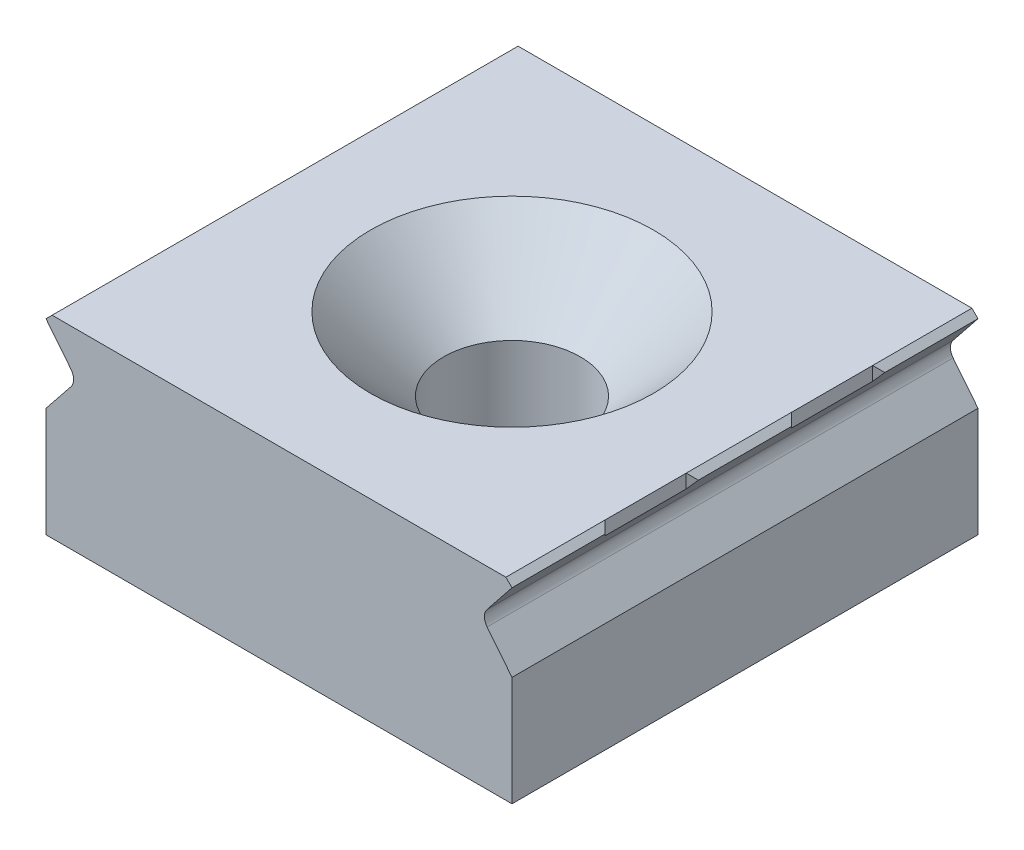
ISO-10303-21;
HEADER;
FILE_DESCRIPTION(('STEP AP214'),'2;1');
FILE_NAME('part.step','',(''),(''),'','','');
FILE_SCHEMA(('AUTOMOTIVE_DESIGN { 1 0 10303 214 1 1 1 1 }'));
ENDSEC;
DATA;
#1=APPLICATION_CONTEXT('core data for automotive mechanical design processes');
#2=APPLICATION_PROTOCOL_DEFINITION('international standard','automotive_design',2000,#1);
#3=PRODUCT_CONTEXT('',#1,'mechanical');
#4=PRODUCT('Part','Part','',(#3));
#5=PRODUCT_RELATED_PRODUCT_CATEGORY('part','',(#4));
#6=PRODUCT_DEFINITION_FORMATION('','',#4);
#7=PRODUCT_DEFINITION_CONTEXT('part definition',#1,'design');
#8=PRODUCT_DEFINITION('design','',#6,#7);
#9=PRODUCT_DEFINITION_SHAPE('','',#8);
#10=(LENGTH_UNIT() NAMED_UNIT(*) SI_UNIT(.MILLI.,.METRE.));
#11=(NAMED_UNIT(*) PLANE_ANGLE_UNIT() SI_UNIT($,.RADIAN.));
#12=(NAMED_UNIT(*) SI_UNIT($,.STERADIAN.) SOLID_ANGLE_UNIT());
#13=UNCERTAINTY_MEASURE_WITH_UNIT(LENGTH_MEASURE(1.E-05),#10,'distance_accuracy_value','');
#14=(GEOMETRIC_REPRESENTATION_CONTEXT(3) GLOBAL_UNCERTAINTY_ASSIGNED_CONTEXT((#13)) GLOBAL_UNIT_ASSIGNED_CONTEXT((#10,
#11,#12)) REPRESENTATION_CONTEXT('',''));
#15=CARTESIAN_POINT('',(0.,0.,0.));
#16=DIRECTION('',(0.,0.,1.));
#17=DIRECTION('',(1.,0.,0.));
#18=AXIS2_PLACEMENT_3D('',#15,#16,#17);
#19=CARTESIAN_POINT('',(9.3,3.96,0.));
#20=DIRECTION('',(0.707106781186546,0.707106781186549,0.));
#21=DIRECTION('',(0.,0.,1.));
#22=AXIS2_PLACEMENT_3D('',#19,#20,#21);
#23=PLANE('',#22);
#24=DIRECTION('',(0.57735018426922,-0.577350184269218,0.577350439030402));
#25=VECTOR('',#24,1.);
#26=CARTESIAN_POINT('',(10.0200001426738,3.23999985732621,-1.43999964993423));
#27=LINE('',#26,#25);
#28=CARTESIAN_POINT('',(9.3,3.96,-2.16000011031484));
#29=VERTEX_POINT('',#28);
#30=CARTESIAN_POINT('',(9.54999999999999,3.70999999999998,-1.91));
#31=VERTEX_POINT('',#30);
#32=EDGE_CURVE('E244',#29,#31,#27,.T.);
#33=ORIENTED_EDGE('',*,*,#32,.F.);
#34=DIRECTION('',(0.,0.,-1.));
#35=VECTOR('',#34,1.);
#36=CARTESIAN_POINT('',(9.3,3.96,-9.55));
#37=LINE('',#36,#35);
#38=CARTESIAN_POINT('',(9.3,3.96,2.15999988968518));
#39=VERTEX_POINT('',#38);
#40=EDGE_CURVE('E343',#39,#29,#37,.T.);
#41=ORIENTED_EDGE('',*,*,#40,.F.);
#42=DIRECTION('',(-0.577350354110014,0.577350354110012,0.577350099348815));
#43=VECTOR('',#42,1.);
#44=CARTESIAN_POINT('',(10.0199998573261,3.2400001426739,1.4400003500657));
#45=LINE('',#44,#43);
#46=CARTESIAN_POINT('',(9.55,3.70999999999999,1.91));
#47=VERTEX_POINT('',#46);
#48=EDGE_CURVE('E254',#47,#39,#45,.T.);
#49=ORIENTED_EDGE('',*,*,#48,.F.);
#50=DIRECTION('',(0.,0.,1.));
#51=VECTOR('',#50,1.);
#52=CARTESIAN_POINT('',(9.55,3.71,9.55));
#53=LINE('',#52,#51);
#54=EDGE_CURVE('E353',#31,#47,#53,.T.);
#55=ORIENTED_EDGE('',*,*,#54,.F.);
#56=EDGE_LOOP('',(#33,#41,#49,#55));
#57=FACE_BOUND('',#56,.T.);
#58=ADVANCED_FACE('F35',(#57),#23,.T.);
#59=CARTESIAN_POINT('',(-9.3,3.96,0.));
#60=DIRECTION('',(-0.707106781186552,0.707106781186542,0.));
#61=DIRECTION('',(0.,0.,-1.));
#62=AXIS2_PLACEMENT_3D('',#59,#60,#61);
#63=PLANE('',#62);
#64=DIRECTION('',(0.577350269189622,0.577350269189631,-0.577350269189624));
#65=VECTOR('',#64,1.);
#66=CARTESIAN_POINT('',(-10.02,3.23999999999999,-1.44000000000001));
#67=LINE('',#66,#65);
#68=CARTESIAN_POINT('',(-9.55000000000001,3.71,-1.91));
#69=VERTEX_POINT('',#68);
#70=CARTESIAN_POINT('',(-9.3,3.96,-2.16000000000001));
#71=VERTEX_POINT('',#70);
#72=EDGE_CURVE('E196',#69,#71,#67,.T.);
#73=ORIENTED_EDGE('',*,*,#72,.F.);
#74=DIRECTION('',(0.,0.,-1.));
#75=VECTOR('',#74,1.);
#76=CARTESIAN_POINT('',(-9.55,3.71,-9.55));
#77=LINE('',#76,#75);
#78=CARTESIAN_POINT('',(-9.55,3.70999999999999,1.91000000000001));
#79=VERTEX_POINT('',#78);
#80=EDGE_CURVE('E363',#79,#69,#77,.T.);
#81=ORIENTED_EDGE('',*,*,#80,.F.);
#82=DIRECTION('',(-0.577350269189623,-0.577350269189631,-0.577350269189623));
#83=VECTOR('',#82,1.);
#84=CARTESIAN_POINT('',(-10.02,3.24,1.44000000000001));
#85=LINE('',#84,#83);
#86=CARTESIAN_POINT('',(-9.29999999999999,3.96,2.16000000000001));
#87=VERTEX_POINT('',#86);
#88=EDGE_CURVE('E219',#87,#79,#85,.T.);
#89=ORIENTED_EDGE('',*,*,#88,.F.);
#90=DIRECTION('',(0.,0.,1.));
#91=VECTOR('',#90,1.);
#92=CARTESIAN_POINT('',(-9.3,3.96,9.55));
#93=LINE('',#92,#91);
#94=EDGE_CURVE('E217',#71,#87,#93,.T.);
#95=ORIENTED_EDGE('',*,*,#94,.F.);
#96=EDGE_LOOP('',(#73,#81,#89,#95));
#97=FACE_BOUND('',#96,.T.);
#98=ADVANCED_FACE('F218',(#97),#63,.T.);
#99=DIRECTION('',(0.57735018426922,-0.577350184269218,0.577350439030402));
#100=VECTOR('',#99,1.);
#101=CARTESIAN_POINT('',(7.47333310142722,5.78666689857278,3.65333218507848));
#102=LINE('',#101,#100);
#103=CARTESIAN_POINT('',(9.3,3.96,5.47999988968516));
#104=VERTEX_POINT('',#103);
#105=CARTESIAN_POINT('',(9.55,3.70999999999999,5.73));
#106=VERTEX_POINT('',#105);
#107=EDGE_CURVE('E264',#104,#106,#102,.T.);
#108=ORIENTED_EDGE('',*,*,#107,.F.);
#109=CARTESIAN_POINT('',(9.3,3.96,9.55));
#110=VERTEX_POINT('',#109);
#111=EDGE_CURVE('E339',#110,#104,#37,.T.);
#112=ORIENTED_EDGE('',*,*,#111,.F.);
#113=DIRECTION('',(-0.707106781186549,0.707106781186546,0.));
#114=VECTOR('',#113,1.);
#115=CARTESIAN_POINT('',(9.3,3.96,9.55));
#116=LINE('',#115,#114);
#117=CARTESIAN_POINT('',(9.55,3.71,9.55));
#118=VERTEX_POINT('',#117);
#119=EDGE_CURVE('E356',#118,#110,#116,.T.);
#120=ORIENTED_EDGE('',*,*,#119,.F.);
#121=EDGE_CURVE('E348',#106,#118,#53,.T.);
#122=ORIENTED_EDGE('',*,*,#121,.F.);
#123=EDGE_LOOP('',(#108,#112,#120,#122));
#124=FACE_BOUND('',#123,.T.);
#125=ADVANCED_FACE('F406',(#124),#23,.T.);
#126=DIRECTION('',(0.577350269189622,0.577350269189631,-0.577350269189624));
#127=VECTOR('',#126,1.);
#128=CARTESIAN_POINT('',(-7.47333333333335,5.78666666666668,3.65333333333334));
#129=LINE('',#128,#127);
#130=CARTESIAN_POINT('',(-9.55,3.70999999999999,5.73));
#131=VERTEX_POINT('',#130);
#132=CARTESIAN_POINT('',(-9.29999999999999,3.96,5.47999999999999));
#133=VERTEX_POINT('',#132);
#134=EDGE_CURVE('E267',#131,#133,#129,.T.);
#135=ORIENTED_EDGE('',*,*,#134,.F.);
#136=CARTESIAN_POINT('',(-9.55,3.71,9.55));
#137=VERTEX_POINT('',#136);
#138=EDGE_CURVE('E359',#137,#131,#77,.T.);
#139=ORIENTED_EDGE('',*,*,#138,.F.);
#140=DIRECTION('',(-0.707106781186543,-0.707106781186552,0.));
#141=VECTOR('',#140,1.);
#142=CARTESIAN_POINT('',(-9.3,3.96,9.55));
#143=LINE('',#142,#141);
#144=CARTESIAN_POINT('',(-9.3,3.96,9.55));
#145=VERTEX_POINT('',#144);
#146=EDGE_CURVE('E352',#145,#137,#143,.T.);
#147=ORIENTED_EDGE('',*,*,#146,.F.);
#148=EDGE_CURVE('E224',#133,#145,#93,.T.);
#149=ORIENTED_EDGE('',*,*,#148,.F.);
#150=EDGE_LOOP('',(#135,#139,#147,#149));
#151=FACE_BOUND('',#150,.T.);
#152=ADVANCED_FACE('F411',(#151),#63,.T.);
#153=CARTESIAN_POINT('',(9.55,3.96,9.55));
#154=DIRECTION('',(0.,0.,-1.));
#155=DIRECTION('',(-1.,0.,0.));
#156=AXIS2_PLACEMENT_3D('',#153,#154,#155);
#157=PLANE('',#156);
#158=DIRECTION('',(-0.624095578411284,0.781348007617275,0.));
#159=VECTOR('',#158,1.);
#160=CARTESIAN_POINT('',(8.52924571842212,1.80795221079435,9.55));
#161=LINE('',#160,#159);
#162=CARTESIAN_POINT('',(9.55,0.529999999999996,9.55));
#163=VERTEX_POINT('',#162);
#164=CARTESIAN_POINT('',(8.52924571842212,1.80795221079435,9.55));
#165=VERTEX_POINT('',#164);
#166=EDGE_CURVE('E283',#163,#165,#161,.T.);
#167=ORIENTED_EDGE('',*,*,#166,.T.);
#168=CARTESIAN_POINT('',(8.91991972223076,2.12,9.55));
#169=DIRECTION('',(0.,0.,-1.));
#170=DIRECTION('',(1.,0.,0.));
#171=AXIS2_PLACEMENT_3D('',#168,#169,#170);
#172=CIRCLE('',#171,0.5);
#173=CARTESIAN_POINT('',(8.52924571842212,2.43204778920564,9.55));
#174=VERTEX_POINT('',#173);
#175=EDGE_CURVE('E280',#165,#174,#172,.T.);
#176=ORIENTED_EDGE('',*,*,#175,.T.);
#177=DIRECTION('',(0.624095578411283,0.781348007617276,0.));
#178=VECTOR('',#177,1.);
#179=CARTESIAN_POINT('',(9.55,3.71,9.55));
#180=LINE('',#179,#178);
#181=EDGE_CURVE('E269',#174,#118,#180,.T.);
#182=ORIENTED_EDGE('',*,*,#181,.T.);
#183=ORIENTED_EDGE('',*,*,#119,.T.);
#184=DIRECTION('',(1.,0.,0.));
#185=VECTOR('',#184,1.);
#186=CARTESIAN_POINT('',(9.55,3.96,9.55));
#187=LINE('',#186,#185);
#188=EDGE_CURVE('E315',#145,#110,#187,.T.);
#189=ORIENTED_EDGE('',*,*,#188,.F.);
#190=ORIENTED_EDGE('',*,*,#146,.T.);
#191=DIRECTION('',(-0.624095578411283,0.781348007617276,0.));
#192=VECTOR('',#191,1.);
#193=CARTESIAN_POINT('',(-9.55,3.71,9.55));
#194=LINE('',#193,#192);
#195=CARTESIAN_POINT('',(-8.52924571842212,2.43204778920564,9.55));
#196=VERTEX_POINT('',#195);
#197=EDGE_CURVE('E277',#196,#137,#194,.T.);
#198=ORIENTED_EDGE('',*,*,#197,.F.);
#199=CARTESIAN_POINT('',(-8.91991972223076,2.12,9.55));
#200=DIRECTION('',(0.,0.,1.));
#201=DIRECTION('',(-1.,0.,0.));
#202=AXIS2_PLACEMENT_3D('',#199,#200,#201);
#203=CIRCLE('',#202,0.5);
#204=CARTESIAN_POINT('',(-8.52924571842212,1.80795221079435,9.55));
#205=VERTEX_POINT('',#204);
#206=EDGE_CURVE('E307',#205,#196,#203,.T.);
#207=ORIENTED_EDGE('',*,*,#206,.F.);
#208=DIRECTION('',(0.624095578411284,0.781348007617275,0.));
#209=VECTOR('',#208,1.);
#210=CARTESIAN_POINT('',(-8.52924571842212,1.80795221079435,9.55));
#211=LINE('',#210,#209);
#212=CARTESIAN_POINT('',(-9.55,0.529999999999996,9.55));
#213=VERTEX_POINT('',#212);
#214=EDGE_CURVE('E304',#213,#205,#211,.T.);
#215=ORIENTED_EDGE('',*,*,#214,.F.);
#216=DIRECTION('',(0.,-1.,0.));
#217=VECTOR('',#216,1.);
#218=CARTESIAN_POINT('',(-9.55,3.96,9.55));
#219=LINE('',#218,#217);
#220=CARTESIAN_POINT('',(-9.55,-3.96,9.55));
#221=VERTEX_POINT('',#220);
#222=EDGE_CURVE('E336',#213,#221,#219,.T.);
#223=ORIENTED_EDGE('',*,*,#222,.T.);
#224=DIRECTION('',(1.,0.,0.));
#225=VECTOR('',#224,1.);
#226=CARTESIAN_POINT('',(9.55,-3.96,9.55));
#227=LINE('',#226,#225);
#228=CARTESIAN_POINT('',(9.55,-3.96,9.55));
#229=VERTEX_POINT('',#228);
#230=EDGE_CURVE('E323',#221,#229,#227,.T.);
#231=ORIENTED_EDGE('',*,*,#230,.T.);
#232=DIRECTION('',(0.,-1.,0.));
#233=VECTOR('',#232,1.);
#234=CARTESIAN_POINT('',(9.55,3.96,9.55));
#235=LINE('',#234,#233);
#236=EDGE_CURVE('E334',#163,#229,#235,.T.);
#237=ORIENTED_EDGE('',*,*,#236,.F.);
#238=EDGE_LOOP('',(#167,#176,#182,#183,#189,#190,#198,#207,#215,#223,#231,#237));
#239=FACE_BOUND('',#238,.T.);
#240=ADVANCED_FACE('F464',(#239),#157,.F.);
#241=CARTESIAN_POINT('',(9.55,3.96,9.55));
#242=DIRECTION('',(-1.,0.,0.));
#243=DIRECTION('',(0.,0.,1.));
#244=AXIS2_PLACEMENT_3D('',#241,#242,#243);
#245=PLANE('',#244);
#246=DIRECTION('',(0.,0.,1.));
#247=VECTOR('',#246,1.);
#248=CARTESIAN_POINT('',(9.55,0.529999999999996,-12.9248305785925));
#249=LINE('',#248,#247);
#250=CARTESIAN_POINT('',(9.55,0.529999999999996,-9.55));
#251=VERTEX_POINT('',#250);
#252=EDGE_CURVE('E287',#251,#163,#249,.T.);
#253=ORIENTED_EDGE('',*,*,#252,.T.);
#254=ORIENTED_EDGE('',*,*,#236,.T.);
#255=DIRECTION('',(0.,0.,-1.));
#256=VECTOR('',#255,1.);
#257=CARTESIAN_POINT('',(9.55,-3.96,9.55));
#258=LINE('',#257,#256);
#259=CARTESIAN_POINT('',(9.55,-3.96,-9.55));
#260=VERTEX_POINT('',#259);
#261=EDGE_CURVE('E326',#229,#260,#258,.T.);
#262=ORIENTED_EDGE('',*,*,#261,.T.);
#263=DIRECTION('',(0.,-1.,0.));
#264=VECTOR('',#263,1.);
#265=CARTESIAN_POINT('',(9.55,3.96,-9.55));
#266=LINE('',#265,#264);
#267=EDGE_CURVE('E332',#251,#260,#266,.T.);
#268=ORIENTED_EDGE('',*,*,#267,.F.);
#269=EDGE_LOOP('',(#253,#254,#262,#268));
#270=FACE_BOUND('',#269,.T.);
#271=ADVANCED_FACE('F538',(#270),#245,.F.);
#272=CARTESIAN_POINT('',(9.55,3.96,-9.55));
#273=DIRECTION('',(0.,0.,1.));
#274=DIRECTION('',(1.,0.,0.));
#275=AXIS2_PLACEMENT_3D('',#272,#273,#274);
#276=PLANE('',#275);
#277=DIRECTION('',(0.624095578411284,-0.781348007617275,0.));
#278=VECTOR('',#277,1.);
#279=CARTESIAN_POINT('',(8.52924571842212,1.80795221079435,-9.55));
#280=LINE('',#279,#278);
#281=CARTESIAN_POINT('',(8.52924571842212,1.80795221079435,-9.55));
#282=VERTEX_POINT('',#281);
#283=EDGE_CURVE('E270',#282,#251,#280,.T.);
#284=ORIENTED_EDGE('',*,*,#283,.T.);
#285=ORIENTED_EDGE('',*,*,#267,.T.);
#286=DIRECTION('',(-1.,0.,0.));
#287=VECTOR('',#286,1.);
#288=CARTESIAN_POINT('',(9.55,-3.96,-9.55));
#289=LINE('',#288,#287);
#290=CARTESIAN_POINT('',(-9.55,-3.96,-9.55));
#291=VERTEX_POINT('',#290);
#292=EDGE_CURVE('E318',#260,#291,#289,.T.);
#293=ORIENTED_EDGE('',*,*,#292,.T.);
#294=DIRECTION('',(0.,-1.,0.));
#295=VECTOR('',#294,1.);
#296=CARTESIAN_POINT('',(-9.55,3.96,-9.55));
#297=LINE('',#296,#295);
#298=CARTESIAN_POINT('',(-9.55,0.529999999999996,-9.55));
#299=VERTEX_POINT('',#298);
#300=EDGE_CURVE('E320',#299,#291,#297,.T.);
#301=ORIENTED_EDGE('',*,*,#300,.F.);
#302=DIRECTION('',(-0.624095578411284,-0.781348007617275,0.));
#303=VECTOR('',#302,1.);
#304=CARTESIAN_POINT('',(-8.52924571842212,1.80795221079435,-9.55));
#305=LINE('',#304,#303);
#306=CARTESIAN_POINT('',(-8.52924571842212,1.80795221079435,-9.55));
#307=VERTEX_POINT('',#306);
#308=EDGE_CURVE('E295',#307,#299,#305,.T.);
#309=ORIENTED_EDGE('',*,*,#308,.F.);
#310=CARTESIAN_POINT('',(-8.91991972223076,2.12,-9.55));
#311=DIRECTION('',(0.,0.,1.));
#312=DIRECTION('',(1.,0.,0.));
#313=AXIS2_PLACEMENT_3D('',#310,#311,#312);
#314=CIRCLE('',#313,0.5);
#315=CARTESIAN_POINT('',(-8.52924571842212,2.43204778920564,-9.55));
#316=VERTEX_POINT('',#315);
#317=EDGE_CURVE('E297',#316,#307,#314,.F.);
#318=ORIENTED_EDGE('',*,*,#317,.F.);
#319=DIRECTION('',(0.624095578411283,-0.781348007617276,0.));
#320=VECTOR('',#319,1.);
#321=CARTESIAN_POINT('',(-9.55,3.71,-9.55));
#322=LINE('',#321,#320);
#323=CARTESIAN_POINT('',(-9.55,3.71,-9.55));
#324=VERTEX_POINT('',#323);
#325=EDGE_CURVE('E300',#324,#316,#322,.T.);
#326=ORIENTED_EDGE('',*,*,#325,.F.);
#327=DIRECTION('',(0.707106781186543,0.707106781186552,0.));
#328=VECTOR('',#327,1.);
#329=CARTESIAN_POINT('',(-9.3,3.96,-9.55));
#330=LINE('',#329,#328);
#331=CARTESIAN_POINT('',(-9.3,3.96,-9.55));
#332=VERTEX_POINT('',#331);
#333=EDGE_CURVE('E342',#324,#332,#330,.T.);
#334=ORIENTED_EDGE('',*,*,#333,.T.);
#335=DIRECTION('',(-1.,0.,0.));
#336=VECTOR('',#335,1.);
#337=CARTESIAN_POINT('',(9.55,3.96,-9.55));
#338=LINE('',#337,#336);
#339=CARTESIAN_POINT('',(9.3,3.96,-9.55));
#340=VERTEX_POINT('',#339);
#341=EDGE_CURVE('E317',#340,#332,#338,.T.);
#342=ORIENTED_EDGE('',*,*,#341,.F.);
#343=DIRECTION('',(0.707106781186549,-0.707106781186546,0.));
#344=VECTOR('',#343,1.);
#345=CARTESIAN_POINT('',(9.3,3.96,-9.55));
#346=LINE('',#345,#344);
#347=CARTESIAN_POINT('',(9.55,3.71,-9.55));
#348=VERTEX_POINT('',#347);
#349=EDGE_CURVE('E345',#340,#348,#346,.T.);
#350=ORIENTED_EDGE('',*,*,#349,.T.);
#351=DIRECTION('',(-0.624095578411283,-0.781348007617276,0.));
#352=VECTOR('',#351,1.);
#353=CARTESIAN_POINT('',(9.55,3.71,-9.55));
#354=LINE('',#353,#352);
#355=CARTESIAN_POINT('',(8.52924571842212,2.43204778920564,-9.55));
#356=VERTEX_POINT('',#355);
#357=EDGE_CURVE('E273',#348,#356,#354,.T.);
#358=ORIENTED_EDGE('',*,*,#357,.T.);
#359=CARTESIAN_POINT('',(8.91991972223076,2.12,-9.55));
#360=DIRECTION('',(0.,0.,1.));
#361=DIRECTION('',(1.,0.,0.));
#362=AXIS2_PLACEMENT_3D('',#359,#360,#361);
#363=CIRCLE('',#362,0.5);
#364=EDGE_CURVE('E274',#356,#282,#363,.T.);
#365=ORIENTED_EDGE('',*,*,#364,.T.);
#366=EDGE_LOOP('',(#284,#285,#293,#301,#309,#318,#326,#334,#342,#350,#358,#365));
#367=FACE_BOUND('',#366,.T.);
#368=ADVANCED_FACE('F442',(#367),#276,.F.);
#369=CARTESIAN_POINT('',(-9.55,3.96,9.55));
#370=DIRECTION('',(1.,0.,0.));
#371=DIRECTION('',(0.,0.,-1.));
#372=AXIS2_PLACEMENT_3D('',#369,#370,#371);
#373=PLANE('',#372);
#374=ORIENTED_EDGE('',*,*,#222,.F.);
#375=DIRECTION('',(0.,0.,1.));
#376=VECTOR('',#375,1.);
#377=CARTESIAN_POINT('',(-9.55,0.529999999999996,-12.9248305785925));
#378=LINE('',#377,#376);
#379=EDGE_CURVE('E310',#299,#213,#378,.T.);
#380=ORIENTED_EDGE('',*,*,#379,.F.);
#381=ORIENTED_EDGE('',*,*,#300,.T.);
#382=DIRECTION('',(0.,0.,1.));
#383=VECTOR('',#382,1.);
#384=CARTESIAN_POINT('',(-9.55,-3.96,9.55));
#385=LINE('',#384,#383);
#386=EDGE_CURVE('E302',#291,#221,#385,.T.);
#387=ORIENTED_EDGE('',*,*,#386,.T.);
#388=EDGE_LOOP('',(#374,#380,#381,#387));
#389=FACE_BOUND('',#388,.T.);
#390=ADVANCED_FACE('F533',(#389),#373,.F.);
#391=CARTESIAN_POINT('',(0.,3.96,0.));
#392=DIRECTION('',(0.,1.,0.));
#393=DIRECTION('',(0.,0.,1.));
#394=AXIS2_PLACEMENT_3D('',#391,#392,#393);
#395=PLANE('',#394);
#396=CARTESIAN_POINT('',(0.,3.96,0.));
#397=DIRECTION('',(0.,1.,0.));
#398=DIRECTION('',(0.,0.,1.));
#399=AXIS2_PLACEMENT_3D('',#396,#397,#398);
#400=CIRCLE('',#399,5.80000000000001);
#401=CARTESIAN_POINT('',(0.,3.96,5.80000000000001));
#402=VERTEX_POINT('',#401);
#403=EDGE_CURVE('E11',#402,#402,#400,.F.);
#404=ORIENTED_EDGE('',*,*,#403,.T.);
#405=EDGE_LOOP('',(#404));
#406=FACE_BOUND('',#405,.T.);
#407=ORIENTED_EDGE('',*,*,#188,.T.);
#408=ORIENTED_EDGE('',*,*,#111,.T.);
#409=DIRECTION('',(0.,0.,1.));
#410=VECTOR('',#409,1.);
#411=CARTESIAN_POINT('',(9.3,3.96,5.47999988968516));
#412=LINE('',#411,#410);
#413=EDGE_CURVE('E206',#39,#104,#412,.T.);
#414=ORIENTED_EDGE('',*,*,#413,.F.);
#415=ORIENTED_EDGE('',*,*,#40,.T.);
#416=DIRECTION('',(0.,0.,1.));
#417=VECTOR('',#416,1.);
#418=CARTESIAN_POINT('',(9.3,3.96,-2.16000011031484));
#419=LINE('',#418,#417);
#420=CARTESIAN_POINT('',(9.3,3.96,-5.48000011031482));
#421=VERTEX_POINT('',#420);
#422=EDGE_CURVE('E239',#421,#29,#419,.T.);
#423=ORIENTED_EDGE('',*,*,#422,.F.);
#424=EDGE_CURVE('E338',#421,#340,#37,.T.);
#425=ORIENTED_EDGE('',*,*,#424,.T.);
#426=ORIENTED_EDGE('',*,*,#341,.T.);
#427=CARTESIAN_POINT('',(-9.3,3.96,-5.47999999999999));
#428=VERTEX_POINT('',#427);
#429=EDGE_CURVE('E223',#332,#428,#93,.T.);
#430=ORIENTED_EDGE('',*,*,#429,.T.);
#431=DIRECTION('',(0.,0.,-1.));
#432=VECTOR('',#431,1.);
#433=CARTESIAN_POINT('',(-9.3,3.96,-5.47999999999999));
#434=LINE('',#433,#432);
#435=EDGE_CURVE('E211',#71,#428,#434,.T.);
#436=ORIENTED_EDGE('',*,*,#435,.F.);
#437=ORIENTED_EDGE('',*,*,#94,.T.);
#438=DIRECTION('',(0.,0.,-1.));
#439=VECTOR('',#438,1.);
#440=CARTESIAN_POINT('',(-9.29999999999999,3.96,2.16000000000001));
#441=LINE('',#440,#439);
#442=EDGE_CURVE('E247',#133,#87,#441,.T.);
#443=ORIENTED_EDGE('',*,*,#442,.F.);
#444=ORIENTED_EDGE('',*,*,#148,.T.);
#445=EDGE_LOOP('',(#407,#408,#414,#415,#423,#425,#426,#430,#436,#437,#443,#444));
#446=FACE_BOUND('',#445,.T.);
#447=ADVANCED_FACE('F228',(#406,#446),#395,.T.);
#448=CARTESIAN_POINT('',(0.,-3.96,0.));
#449=DIRECTION('',(0.,1.,0.));
#450=DIRECTION('',(0.,0.,1.));
#451=AXIS2_PLACEMENT_3D('',#448,#449,#450);
#452=PLANE('',#451);
#453=CARTESIAN_POINT('',(0.,-3.96,0.));
#454=DIRECTION('',(0.,1.,0.));
#455=DIRECTION('',(0.,0.,1.));
#456=AXIS2_PLACEMENT_3D('',#453,#454,#455);
#457=CIRCLE('',#456,2.8);
#458=CARTESIAN_POINT('',(0.,-3.96,2.8));
#459=VERTEX_POINT('',#458);
#460=EDGE_CURVE('E236',#459,#459,#457,.F.);
#461=ORIENTED_EDGE('',*,*,#460,.F.);
#462=EDGE_LOOP('',(#461));
#463=FACE_BOUND('',#462,.T.);
#464=ORIENTED_EDGE('',*,*,#386,.F.);
#465=ORIENTED_EDGE('',*,*,#292,.F.);
#466=ORIENTED_EDGE('',*,*,#261,.F.);
#467=ORIENTED_EDGE('',*,*,#230,.F.);
#468=EDGE_LOOP('',(#464,#465,#466,#467));
#469=FACE_BOUND('',#468,.T.);
#470=ADVANCED_FACE('F418',(#463,#469),#452,.F.);
#471=DIRECTION('',(-0.577350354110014,0.577350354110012,0.577350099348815));
#472=VECTOR('',#471,1.);
#473=CARTESIAN_POINT('',(7.4733335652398,5.7866664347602,-3.65333448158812));
#474=LINE('',#473,#472);
#475=CARTESIAN_POINT('',(9.55,3.70999999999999,-5.73));
#476=VERTEX_POINT('',#475);
#477=EDGE_CURVE('E237',#476,#421,#474,.T.);
#478=ORIENTED_EDGE('',*,*,#477,.F.);
#479=EDGE_CURVE('E349',#348,#476,#53,.T.);
#480=ORIENTED_EDGE('',*,*,#479,.F.);
#481=ORIENTED_EDGE('',*,*,#349,.F.);
#482=ORIENTED_EDGE('',*,*,#424,.F.);
#483=EDGE_LOOP('',(#478,#480,#481,#482));
#484=FACE_BOUND('',#483,.T.);
#485=ADVANCED_FACE('F407',(#484),#23,.T.);
#486=DIRECTION('',(-0.577350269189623,-0.577350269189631,-0.577350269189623));
#487=VECTOR('',#486,1.);
#488=CARTESIAN_POINT('',(-7.47333333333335,5.78666666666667,-3.65333333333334));
#489=LINE('',#488,#487);
#490=CARTESIAN_POINT('',(-9.55,3.71,-5.73));
#491=VERTEX_POINT('',#490);
#492=EDGE_CURVE('E207',#428,#491,#489,.T.);
#493=ORIENTED_EDGE('',*,*,#492,.F.);
#494=ORIENTED_EDGE('',*,*,#429,.F.);
#495=ORIENTED_EDGE('',*,*,#333,.F.);
#496=EDGE_CURVE('E358',#491,#324,#77,.T.);
#497=ORIENTED_EDGE('',*,*,#496,.F.);
#498=EDGE_LOOP('',(#493,#494,#495,#497));
#499=FACE_BOUND('',#498,.T.);
#500=ADVANCED_FACE('F412',(#499),#63,.T.);
#501=CARTESIAN_POINT('',(-9.55,3.71,-12.9248305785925));
#502=DIRECTION('',(0.781348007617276,0.624095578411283,0.));
#503=DIRECTION('',(-0.624095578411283,0.781348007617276,0.));
#504=AXIS2_PLACEMENT_3D('',#501,#502,#503);
#505=PLANE('',#504);
#506=ORIENTED_EDGE('',*,*,#80,.T.);
#507=DIRECTION('',(0.529447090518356,-0.662851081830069,-0.529447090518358));
#508=VECTOR('',#507,1.);
#509=CARTESIAN_POINT('',(-6.46238633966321,-0.155595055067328,-4.9976136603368));
#510=LINE('',#509,#508);
#511=CARTESIAN_POINT('',(-9.3,3.39700787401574,-2.16000000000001));
#512=VERTEX_POINT('',#511);
#513=EDGE_CURVE('E201',#69,#512,#510,.T.);
#514=ORIENTED_EDGE('',*,*,#513,.T.);
#515=DIRECTION('',(0.,0.,-1.));
#516=VECTOR('',#515,1.);
#517=CARTESIAN_POINT('',(-9.3,3.39700787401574,-12.9248305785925));
#518=LINE('',#517,#516);
#519=CARTESIAN_POINT('',(-9.3,3.39700787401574,-5.47999999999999));
#520=VERTEX_POINT('',#519);
#521=EDGE_CURVE('E214',#512,#520,#518,.T.);
#522=ORIENTED_EDGE('',*,*,#521,.T.);
#523=DIRECTION('',(-0.529447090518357,0.662851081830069,-0.529447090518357));
#524=VECTOR('',#523,1.);
#525=CARTESIAN_POINT('',(-11.5668133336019,6.23498677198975,-7.74681333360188));
#526=LINE('',#525,#524);
#527=EDGE_CURVE('E387',#520,#491,#526,.T.);
#528=ORIENTED_EDGE('',*,*,#527,.T.);
#529=ORIENTED_EDGE('',*,*,#496,.T.);
#530=ORIENTED_EDGE('',*,*,#325,.T.);
#531=DIRECTION('',(0.,0.,1.));
#532=VECTOR('',#531,1.);
#533=CARTESIAN_POINT('',(-8.52924571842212,2.43204778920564,-12.9248305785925));
#534=LINE('',#533,#532);
#535=EDGE_CURVE('E298',#316,#196,#534,.T.);
#536=ORIENTED_EDGE('',*,*,#535,.T.);
#537=ORIENTED_EDGE('',*,*,#197,.T.);
#538=ORIENTED_EDGE('',*,*,#138,.T.);
#539=DIRECTION('',(0.529447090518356,-0.662851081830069,-0.529447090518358));
#540=VECTOR('',#539,1.);
#541=CARTESIAN_POINT('',(-4.32078568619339,-2.83681162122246,0.50078568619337));
#542=LINE('',#541,#540);
#543=CARTESIAN_POINT('',(-9.29999999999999,3.39700787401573,5.47999999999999));
#544=VERTEX_POINT('',#543);
#545=EDGE_CURVE('E377',#131,#544,#542,.T.);
#546=ORIENTED_EDGE('',*,*,#545,.T.);
#547=DIRECTION('',(0.,0.,-1.));
#548=VECTOR('',#547,1.);
#549=CARTESIAN_POINT('',(-9.29999999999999,3.39700787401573,-12.9248305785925));
#550=LINE('',#549,#548);
#551=CARTESIAN_POINT('',(-9.29999999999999,3.39700787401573,2.16000000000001));
#552=VERTEX_POINT('',#551);
#553=EDGE_CURVE('E371',#544,#552,#550,.T.);
#554=ORIENTED_EDGE('',*,*,#553,.T.);
#555=DIRECTION('',(-0.529447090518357,0.662851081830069,-0.529447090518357));
#556=VECTOR('',#555,1.);
#557=CARTESIAN_POINT('',(-13.7084139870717,8.91620333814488,-2.2484139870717));
#558=LINE('',#557,#556);
#559=EDGE_CURVE('E374',#552,#79,#558,.T.);
#560=ORIENTED_EDGE('',*,*,#559,.T.);
#561=EDGE_LOOP('',(#506,#514,#522,#528,#529,#530,#536,#537,#538,#546,#554,#560));
#562=FACE_BOUND('',#561,.T.);
#563=ADVANCED_FACE('F424',(#562),#505,.F.);
#564=CARTESIAN_POINT('',(-8.91991972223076,2.12,-12.9248305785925));
#565=DIRECTION('',(0.,0.,1.));
#566=DIRECTION('',(1.,0.,0.));
#567=AXIS2_PLACEMENT_3D('',#564,#565,#566);
#568=CYLINDRICAL_SURFACE('',#567,0.5);
#569=ORIENTED_EDGE('',*,*,#317,.T.);
#570=DIRECTION('',(0.,0.,1.));
#571=VECTOR('',#570,1.);
#572=CARTESIAN_POINT('',(-8.52924571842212,1.80795221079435,-12.9248305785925));
#573=LINE('',#572,#571);
#574=EDGE_CURVE('E312',#307,#205,#573,.T.);
#575=ORIENTED_EDGE('',*,*,#574,.T.);
#576=ORIENTED_EDGE('',*,*,#206,.T.);
#577=ORIENTED_EDGE('',*,*,#535,.F.);
#578=EDGE_LOOP('',(#569,#575,#576,#577));
#579=FACE_BOUND('',#578,.T.);
#580=ADVANCED_FACE('F523',(#579),#568,.F.);
#581=CARTESIAN_POINT('',(-8.52924571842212,1.80795221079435,-12.9248305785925));
#582=DIRECTION('',(0.781348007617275,-0.624095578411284,0.));
#583=DIRECTION('',(0.624095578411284,0.781348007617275,0.));
#584=AXIS2_PLACEMENT_3D('',#581,#582,#583);
#585=PLANE('',#584);
#586=ORIENTED_EDGE('',*,*,#308,.T.);
#587=ORIENTED_EDGE('',*,*,#379,.T.);
#588=ORIENTED_EDGE('',*,*,#214,.T.);
#589=ORIENTED_EDGE('',*,*,#574,.F.);
#590=EDGE_LOOP('',(#586,#587,#588,#589));
#591=FACE_BOUND('',#590,.T.);
#592=ADVANCED_FACE('F519',(#591),#585,.F.);
#593=CARTESIAN_POINT('',(8.91991972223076,2.12,-12.9248305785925));
#594=DIRECTION('',(0.,0.,1.));
#595=DIRECTION('',(1.,0.,0.));
#596=AXIS2_PLACEMENT_3D('',#593,#594,#595);
#597=CYLINDRICAL_SURFACE('',#596,0.5);
#598=DIRECTION('',(0.,0.,1.));
#599=VECTOR('',#598,1.);
#600=CARTESIAN_POINT('',(8.52924571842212,2.43204778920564,-12.9248305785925));
#601=LINE('',#600,#599);
#602=EDGE_CURVE('E286',#356,#174,#601,.T.);
#603=ORIENTED_EDGE('',*,*,#602,.T.);
#604=ORIENTED_EDGE('',*,*,#175,.F.);
#605=DIRECTION('',(0.,0.,1.));
#606=VECTOR('',#605,1.);
#607=CARTESIAN_POINT('',(8.52924571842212,1.80795221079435,-12.9248305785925));
#608=LINE('',#607,#606);
#609=EDGE_CURVE('E290',#282,#165,#608,.T.);
#610=ORIENTED_EDGE('',*,*,#609,.F.);
#611=ORIENTED_EDGE('',*,*,#364,.F.);
#612=EDGE_LOOP('',(#603,#604,#610,#611));
#613=FACE_BOUND('',#612,.T.);
#614=ADVANCED_FACE('F515',(#613),#597,.F.);
#615=CARTESIAN_POINT('',(8.52924571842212,1.80795221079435,-12.9248305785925));
#616=DIRECTION('',(0.781348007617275,0.624095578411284,0.));
#617=DIRECTION('',(-0.624095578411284,0.781348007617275,0.));
#618=AXIS2_PLACEMENT_3D('',#615,#616,#617);
#619=PLANE('',#618);
#620=ORIENTED_EDGE('',*,*,#609,.T.);
#621=ORIENTED_EDGE('',*,*,#166,.F.);
#622=ORIENTED_EDGE('',*,*,#252,.F.);
#623=ORIENTED_EDGE('',*,*,#283,.F.);
#624=EDGE_LOOP('',(#620,#621,#622,#623));
#625=FACE_BOUND('',#624,.T.);
#626=ADVANCED_FACE('F512',(#625),#619,.T.);
#627=CARTESIAN_POINT('',(9.55,3.71,-12.9248305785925));
#628=DIRECTION('',(0.781348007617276,-0.624095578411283,0.));
#629=DIRECTION('',(0.624095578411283,0.781348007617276,0.));
#630=AXIS2_PLACEMENT_3D('',#627,#628,#629);
#631=PLANE('',#630);
#632=DIRECTION('',(-0.529447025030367,-0.662850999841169,-0.529447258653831));
#633=VECTOR('',#632,1.);
#634=CARTESIAN_POINT('',(6.46238574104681,-0.155595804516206,-4.99761562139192));
#635=LINE('',#634,#633);
#636=CARTESIAN_POINT('',(9.3,3.39700787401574,-2.16000011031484));
#637=VERTEX_POINT('',#636);
#638=EDGE_CURVE('E384',#31,#637,#635,.T.);
#639=ORIENTED_EDGE('',*,*,#638,.F.);
#640=ORIENTED_EDGE('',*,*,#54,.T.);
#641=DIRECTION('',(0.529447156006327,0.662851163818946,-0.529446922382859));
#642=VECTOR('',#641,1.);
#643=CARTESIAN_POINT('',(13.7084131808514,8.91620232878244,-2.24841134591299));
#644=LINE('',#643,#642);
#645=CARTESIAN_POINT('',(9.3,3.39700787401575,2.15999988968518));
#646=VERTEX_POINT('',#645);
#647=EDGE_CURVE('E362',#646,#47,#644,.T.);
#648=ORIENTED_EDGE('',*,*,#647,.F.);
#649=DIRECTION('',(0.,0.,-1.));
#650=VECTOR('',#649,1.);
#651=CARTESIAN_POINT('',(9.30000000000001,3.39700787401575,-12.9248305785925));
#652=LINE('',#651,#650);
#653=CARTESIAN_POINT('',(9.3,3.39700787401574,5.47999988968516));
#654=VERTEX_POINT('',#653);
#655=EDGE_CURVE('E366',#654,#646,#652,.T.);
#656=ORIENTED_EDGE('',*,*,#655,.F.);
#657=DIRECTION('',(-0.529447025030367,-0.662850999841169,-0.529447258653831));
#658=VECTOR('',#657,1.);
#659=CARTESIAN_POINT('',(4.32078467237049,-2.8368128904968,0.500782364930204));
#660=LINE('',#659,#658);
#661=EDGE_CURVE('E369',#106,#654,#660,.T.);
#662=ORIENTED_EDGE('',*,*,#661,.F.);
#663=ORIENTED_EDGE('',*,*,#121,.T.);
#664=ORIENTED_EDGE('',*,*,#181,.F.);
#665=ORIENTED_EDGE('',*,*,#602,.F.);
#666=ORIENTED_EDGE('',*,*,#357,.F.);
#667=ORIENTED_EDGE('',*,*,#479,.T.);
#668=DIRECTION('',(0.529447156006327,0.662851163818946,-0.529446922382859));
#669=VECTOR('',#668,1.);
#670=CARTESIAN_POINT('',(11.5668129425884,6.2349862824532,-7.74681205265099));
#671=LINE('',#670,#669);
#672=CARTESIAN_POINT('',(9.3,3.39700787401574,-5.48000011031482));
#673=VERTEX_POINT('',#672);
#674=EDGE_CURVE('E380',#673,#476,#671,.T.);
#675=ORIENTED_EDGE('',*,*,#674,.F.);
#676=DIRECTION('',(0.,0.,-1.));
#677=VECTOR('',#676,1.);
#678=CARTESIAN_POINT('',(9.3,3.39700787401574,-12.9248305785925));
#679=LINE('',#678,#677);
#680=EDGE_CURVE('E382',#637,#673,#679,.T.);
#681=ORIENTED_EDGE('',*,*,#680,.F.);
#682=EDGE_LOOP('',(#639,#640,#648,#656,#662,#663,#664,#665,#666,#667,#675,#681));
#683=FACE_BOUND('',#682,.T.);
#684=ADVANCED_FACE('F436',(#683),#631,.T.);
#685=CARTESIAN_POINT('',(9.55,2.96,5.73));
#686=DIRECTION('',(-0.707106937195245,0.,0.707106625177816));
#687=DIRECTION('',(0.707106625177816,0.,0.707106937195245));
#688=AXIS2_PLACEMENT_3D('',#685,#686,#687);
#689=PLANE('',#688);
#690=ORIENTED_EDGE('',*,*,#107,.T.);
#691=ORIENTED_EDGE('',*,*,#661,.T.);
#692=DIRECTION('',(0.,1.,0.));
#693=VECTOR('',#692,1.);
#694=CARTESIAN_POINT('',(9.3,2.96,5.47999988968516));
#695=LINE('',#694,#693);
#696=EDGE_CURVE('E251',#654,#104,#695,.T.);
#697=ORIENTED_EDGE('',*,*,#696,.T.);
#698=EDGE_LOOP('',(#690,#691,#697));
#699=FACE_BOUND('',#698,.T.);
#700=ADVANCED_FACE('F504',(#699),#689,.F.);
#701=CARTESIAN_POINT('',(9.3,2.96,5.47999988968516));
#702=DIRECTION('',(-1.,0.,0.));
#703=DIRECTION('',(0.,0.,1.));
#704=AXIS2_PLACEMENT_3D('',#701,#702,#703);
#705=PLANE('',#704);
#706=ORIENTED_EDGE('',*,*,#655,.T.);
#707=DIRECTION('',(0.,1.,0.));
#708=VECTOR('',#707,1.);
#709=CARTESIAN_POINT('',(9.3,2.96,2.15999988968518));
#710=LINE('',#709,#708);
#711=EDGE_CURVE('E259',#646,#39,#710,.T.);
#712=ORIENTED_EDGE('',*,*,#711,.T.);
#713=ORIENTED_EDGE('',*,*,#413,.T.);
#714=ORIENTED_EDGE('',*,*,#696,.F.);
#715=EDGE_LOOP('',(#706,#712,#713,#714));
#716=FACE_BOUND('',#715,.T.);
#717=ADVANCED_FACE('F473',(#716),#705,.F.);
#718=CARTESIAN_POINT('',(9.3,2.96,2.15999988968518));
#719=DIRECTION('',(-0.707106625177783,0.,-0.707106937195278));
#720=DIRECTION('',(-0.707106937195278,0.,0.707106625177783));
#721=AXIS2_PLACEMENT_3D('',#718,#719,#720);
#722=PLANE('',#721);
#723=ORIENTED_EDGE('',*,*,#48,.T.);
#724=ORIENTED_EDGE('',*,*,#711,.F.);
#725=ORIENTED_EDGE('',*,*,#647,.T.);
#726=EDGE_LOOP('',(#723,#724,#725));
#727=FACE_BOUND('',#726,.T.);
#728=ADVANCED_FACE('F502',(#727),#722,.F.);
#729=CARTESIAN_POINT('',(-9.29999999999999,2.96,5.47999999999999));
#730=DIRECTION('',(0.707106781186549,0.,0.707106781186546));
#731=DIRECTION('',(0.707106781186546,0.,-0.707106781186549));
#732=AXIS2_PLACEMENT_3D('',#729,#730,#731);
#733=PLANE('',#732);
#734=ORIENTED_EDGE('',*,*,#134,.T.);
#735=DIRECTION('',(0.,1.,0.));
#736=VECTOR('',#735,1.);
#737=CARTESIAN_POINT('',(-9.29999999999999,2.96,5.47999999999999));
#738=LINE('',#737,#736);
#739=EDGE_CURVE('E250',#544,#133,#738,.T.);
#740=ORIENTED_EDGE('',*,*,#739,.F.);
#741=ORIENTED_EDGE('',*,*,#545,.F.);
#742=EDGE_LOOP('',(#734,#740,#741));
#743=FACE_BOUND('',#742,.T.);
#744=ADVANCED_FACE('F497',(#743),#733,.F.);
#745=CARTESIAN_POINT('',(-9.55,2.96,1.91));
#746=DIRECTION('',(0.707106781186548,0.,-0.707106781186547));
#747=DIRECTION('',(-0.707106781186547,0.,-0.707106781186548));
#748=AXIS2_PLACEMENT_3D('',#745,#746,#747);
#749=PLANE('',#748);
#750=ORIENTED_EDGE('',*,*,#88,.T.);
#751=ORIENTED_EDGE('',*,*,#559,.F.);
#752=DIRECTION('',(0.,1.,0.));
#753=VECTOR('',#752,1.);
#754=CARTESIAN_POINT('',(-9.29999999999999,2.96,2.16000000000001));
#755=LINE('',#754,#753);
#756=EDGE_CURVE('E252',#552,#87,#755,.T.);
#757=ORIENTED_EDGE('',*,*,#756,.T.);
#758=EDGE_LOOP('',(#750,#751,#757));
#759=FACE_BOUND('',#758,.T.);
#760=ADVANCED_FACE('F451',(#759),#749,.F.);
#761=CARTESIAN_POINT('',(-9.29999999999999,2.96,2.16000000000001));
#762=DIRECTION('',(1.,0.,0.));
#763=DIRECTION('',(0.,0.,-1.));
#764=AXIS2_PLACEMENT_3D('',#761,#762,#763);
#765=PLANE('',#764);
#766=ORIENTED_EDGE('',*,*,#739,.T.);
#767=ORIENTED_EDGE('',*,*,#442,.T.);
#768=ORIENTED_EDGE('',*,*,#756,.F.);
#769=ORIENTED_EDGE('',*,*,#553,.F.);
#770=EDGE_LOOP('',(#766,#767,#768,#769));
#771=FACE_BOUND('',#770,.T.);
#772=ADVANCED_FACE('F453',(#771),#765,.F.);
#773=CARTESIAN_POINT('',(9.54999999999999,2.96,-1.91));
#774=DIRECTION('',(-0.707106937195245,0.,0.707106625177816));
#775=DIRECTION('',(0.707106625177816,0.,0.707106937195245));
#776=AXIS2_PLACEMENT_3D('',#773,#774,#775);
#777=PLANE('',#776);
#778=ORIENTED_EDGE('',*,*,#32,.T.);
#779=ORIENTED_EDGE('',*,*,#638,.T.);
#780=DIRECTION('',(0.,1.,0.));
#781=VECTOR('',#780,1.);
#782=CARTESIAN_POINT('',(9.3,2.96,-2.16000011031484));
#783=LINE('',#782,#781);
#784=EDGE_CURVE('E231',#637,#29,#783,.T.);
#785=ORIENTED_EDGE('',*,*,#784,.T.);
#786=EDGE_LOOP('',(#778,#779,#785));
#787=FACE_BOUND('',#786,.T.);
#788=ADVANCED_FACE('F480',(#787),#777,.F.);
#789=CARTESIAN_POINT('',(9.3,2.96,-2.16000011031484));
#790=DIRECTION('',(-1.,0.,0.));
#791=DIRECTION('',(0.,0.,1.));
#792=AXIS2_PLACEMENT_3D('',#789,#790,#791);
#793=PLANE('',#792);
#794=ORIENTED_EDGE('',*,*,#680,.T.);
#795=DIRECTION('',(0.,1.,0.));
#796=VECTOR('',#795,1.);
#797=CARTESIAN_POINT('',(9.3,2.96,-5.48000011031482));
#798=LINE('',#797,#796);
#799=EDGE_CURVE('E58',#673,#421,#798,.T.);
#800=ORIENTED_EDGE('',*,*,#799,.T.);
#801=ORIENTED_EDGE('',*,*,#422,.T.);
#802=ORIENTED_EDGE('',*,*,#784,.F.);
#803=EDGE_LOOP('',(#794,#800,#801,#802));
#804=FACE_BOUND('',#803,.T.);
#805=ADVANCED_FACE('F483',(#804),#793,.F.);
#806=CARTESIAN_POINT('',(9.3,2.96,-5.48000011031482));
#807=DIRECTION('',(-0.707106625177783,0.,-0.707106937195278));
#808=DIRECTION('',(-0.707106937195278,0.,0.707106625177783));
#809=AXIS2_PLACEMENT_3D('',#806,#807,#808);
#810=PLANE('',#809);
#811=ORIENTED_EDGE('',*,*,#477,.T.);
#812=ORIENTED_EDGE('',*,*,#799,.F.);
#813=ORIENTED_EDGE('',*,*,#674,.T.);
#814=EDGE_LOOP('',(#811,#812,#813));
#815=FACE_BOUND('',#814,.T.);
#816=ADVANCED_FACE('F485',(#815),#810,.F.);
#817=CARTESIAN_POINT('',(-9.3,2.96,-2.16000000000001));
#818=DIRECTION('',(0.707106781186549,0.,0.707106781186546));
#819=DIRECTION('',(0.707106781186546,0.,-0.707106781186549));
#820=AXIS2_PLACEMENT_3D('',#817,#818,#819);
#821=PLANE('',#820);
#822=ORIENTED_EDGE('',*,*,#72,.T.);
#823=DIRECTION('',(0.,1.,0.));
#824=VECTOR('',#823,1.);
#825=CARTESIAN_POINT('',(-9.3,2.96,-2.16000000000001));
#826=LINE('',#825,#824);
#827=EDGE_CURVE('E199',#512,#71,#826,.T.);
#828=ORIENTED_EDGE('',*,*,#827,.F.);
#829=ORIENTED_EDGE('',*,*,#513,.F.);
#830=EDGE_LOOP('',(#822,#828,#829));
#831=FACE_BOUND('',#830,.T.);
#832=ADVANCED_FACE('F198',(#831),#821,.F.);
#833=CARTESIAN_POINT('',(-9.55,2.96,-5.73));
#834=DIRECTION('',(0.707106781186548,0.,-0.707106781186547));
#835=DIRECTION('',(-0.707106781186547,0.,-0.707106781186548));
#836=AXIS2_PLACEMENT_3D('',#833,#834,#835);
#837=PLANE('',#836);
#838=ORIENTED_EDGE('',*,*,#492,.T.);
#839=ORIENTED_EDGE('',*,*,#527,.F.);
#840=DIRECTION('',(0.,1.,0.));
#841=VECTOR('',#840,1.);
#842=CARTESIAN_POINT('',(-9.3,2.96,-5.47999999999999));
#843=LINE('',#842,#841);
#844=EDGE_CURVE('E50',#520,#428,#843,.T.);
#845=ORIENTED_EDGE('',*,*,#844,.T.);
#846=EDGE_LOOP('',(#838,#839,#845));
#847=FACE_BOUND('',#846,.T.);
#848=ADVANCED_FACE('F447',(#847),#837,.F.);
#849=CARTESIAN_POINT('',(-9.3,2.96,-5.47999999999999));
#850=DIRECTION('',(1.,0.,0.));
#851=DIRECTION('',(0.,0.,-1.));
#852=AXIS2_PLACEMENT_3D('',#849,#850,#851);
#853=PLANE('',#852);
#854=ORIENTED_EDGE('',*,*,#827,.T.);
#855=ORIENTED_EDGE('',*,*,#435,.T.);
#856=ORIENTED_EDGE('',*,*,#844,.F.);
#857=ORIENTED_EDGE('',*,*,#521,.F.);
#858=EDGE_LOOP('',(#854,#855,#856,#857));
#859=FACE_BOUND('',#858,.T.);
#860=ADVANCED_FACE('F209',(#859),#853,.F.);
#861=CARTESIAN_POINT('',(0.,-11.8795959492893,0.));
#862=DIRECTION('',(0.,1.,0.));
#863=DIRECTION('',(0.,0.,1.));
#864=AXIS2_PLACEMENT_3D('',#861,#862,#863);
#865=CYLINDRICAL_SURFACE('',#864,2.8);
#866=CARTESIAN_POINT('',(0.,0.959999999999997,0.));
#867=DIRECTION('',(0.,1.,0.));
#868=DIRECTION('',(0.,0.,1.));
#869=AXIS2_PLACEMENT_3D('',#866,#867,#868);
#870=CIRCLE('',#869,2.8);
#871=CARTESIAN_POINT('',(0.,0.959999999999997,2.8));
#872=VERTEX_POINT('',#871);
#873=EDGE_CURVE('E43',#872,#872,#870,.T.);
#874=ORIENTED_EDGE('',*,*,#873,.T.);
#875=EDGE_LOOP('',(#874));
#876=FACE_BOUND('',#875,.T.);
#877=ORIENTED_EDGE('',*,*,#460,.T.);
#878=EDGE_LOOP('',(#877));
#879=FACE_BOUND('',#878,.T.);
#880=ADVANCED_FACE('F393',(#876,#879),#865,.F.);
#881=CARTESIAN_POINT('',(0.,0.959999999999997,0.));
#882=DIRECTION('',(0.,1.,0.));
#883=DIRECTION('',(0.,0.,1.));
#884=AXIS2_PLACEMENT_3D('',#881,#882,#883);
#885=CONICAL_SURFACE('',#884,2.8,0.78539816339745);
#886=ORIENTED_EDGE('',*,*,#403,.F.);
#887=EDGE_LOOP('',(#886));
#888=FACE_BOUND('',#887,.T.);
#889=ORIENTED_EDGE('',*,*,#873,.F.);
#890=EDGE_LOOP('',(#889));
#891=FACE_BOUND('',#890,.T.);
#892=ADVANCED_FACE('F37',(#888,#891),#885,.F.);
#893=CLOSED_SHELL('',(#58,#98,#125,#152,#240,#271,#368,#390,#447,#470,#485,#500,#563,#580,#592,
#614,#626,#684,#700,#717,#728,#744,#760,#772,#788,#805,#816,#832,#848,#860,#880,#892));
#894=MANIFOLD_SOLID_BREP('B2',#893);
#895=ADVANCED_BREP_SHAPE_REPRESENTATION('',(#18,#894),#14);
#896=SHAPE_DEFINITION_REPRESENTATION(#9,#895);
ENDSEC;
END-ISO-10303-21;
